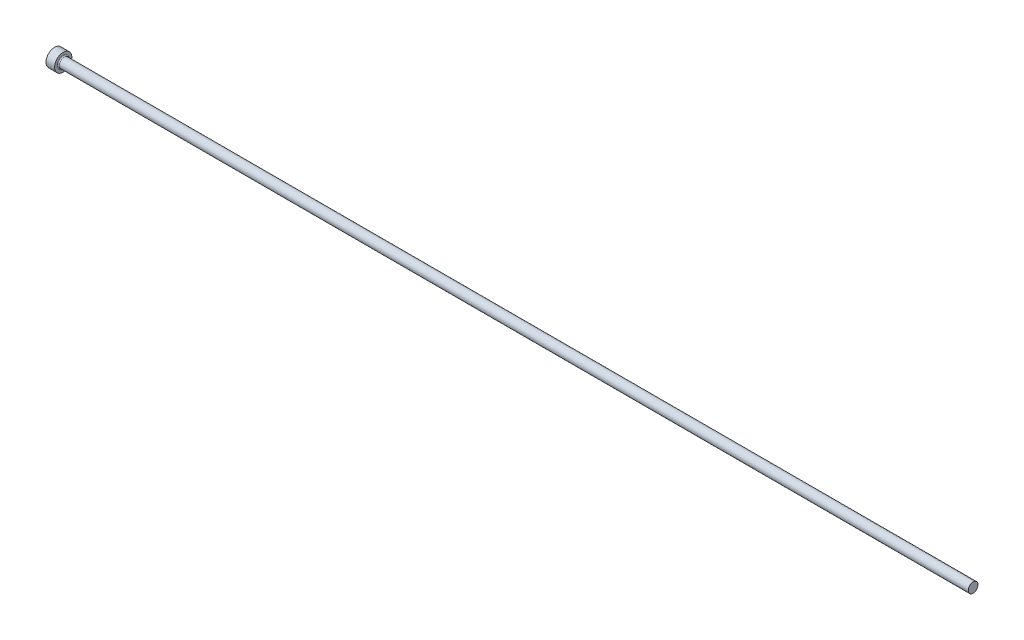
ISO-10303-21;
HEADER;
FILE_DESCRIPTION(('STEP AP214'),'2;1');
FILE_NAME('part.step','',(''),(''),'','','');
FILE_SCHEMA(('AUTOMOTIVE_DESIGN { 1 0 10303 214 1 1 1 1 }'));
ENDSEC;
DATA;
#1=APPLICATION_CONTEXT('core data for automotive mechanical design processes');
#2=APPLICATION_PROTOCOL_DEFINITION('international standard','automotive_design',2000,#1);
#3=PRODUCT_CONTEXT('',#1,'mechanical');
#4=PRODUCT('Part','Part','',(#3));
#5=PRODUCT_RELATED_PRODUCT_CATEGORY('part','',(#4));
#6=PRODUCT_DEFINITION_FORMATION('','',#4);
#7=PRODUCT_DEFINITION_CONTEXT('part definition',#1,'design');
#8=PRODUCT_DEFINITION('design','',#6,#7);
#9=PRODUCT_DEFINITION_SHAPE('','',#8);
#10=(LENGTH_UNIT() NAMED_UNIT(*) SI_UNIT(.MILLI.,.METRE.));
#11=(NAMED_UNIT(*) PLANE_ANGLE_UNIT() SI_UNIT($,.RADIAN.));
#12=(NAMED_UNIT(*) SI_UNIT($,.STERADIAN.) SOLID_ANGLE_UNIT());
#13=UNCERTAINTY_MEASURE_WITH_UNIT(LENGTH_MEASURE(1.E-05),#10,'distance_accuracy_value','');
#14=(GEOMETRIC_REPRESENTATION_CONTEXT(3) GLOBAL_UNCERTAINTY_ASSIGNED_CONTEXT((#13)) GLOBAL_UNIT_ASSIGNED_CONTEXT((#10,
#11,#12)) REPRESENTATION_CONTEXT('',''));
#15=CARTESIAN_POINT('',(0.,0.,0.));
#16=DIRECTION('',(0.,0.,1.));
#17=DIRECTION('',(1.,0.,0.));
#18=AXIS2_PLACEMENT_3D('',#15,#16,#17);
#19=CARTESIAN_POINT('',(0.,0.,0.));
#20=DIRECTION('',(-1.,0.,0.));
#21=DIRECTION('',(0.,-1.,0.));
#22=AXIS2_PLACEMENT_3D('',#19,#20,#21);
#23=PLANE('',#22);
#24=CARTESIAN_POINT('',(0.,0.,0.));
#25=DIRECTION('',(1.,0.,0.));
#26=DIRECTION('',(0.,1.,0.));
#27=AXIS2_PLACEMENT_3D('',#24,#25,#26);
#28=CIRCLE('',#27,1.5);
#29=CARTESIAN_POINT('',(0.,1.5,0.));
#30=VERTEX_POINT('',#29);
#31=EDGE_CURVE('E25',#30,#30,#28,.T.);
#32=ORIENTED_EDGE('',*,*,#31,.F.);
#33=EDGE_LOOP('',(#32));
#34=FACE_BOUND('',#33,.T.);
#35=ADVANCED_FACE('F14',(#34),#23,.T.);
#36=CARTESIAN_POINT('',(160.,0.,0.));
#37=DIRECTION('',(1.,0.,0.));
#38=DIRECTION('',(0.,1.,0.));
#39=AXIS2_PLACEMENT_3D('',#36,#37,#38);
#40=CYLINDRICAL_SURFACE('',#39,1.5);
#41=ORIENTED_EDGE('',*,*,#31,.T.);
#42=EDGE_LOOP('',(#41));
#43=FACE_BOUND('',#42,.T.);
#44=CARTESIAN_POINT('',(1.5,0.,0.));
#45=DIRECTION('',(1.,0.,0.));
#46=DIRECTION('',(0.,1.,0.));
#47=AXIS2_PLACEMENT_3D('',#44,#45,#46);
#48=CIRCLE('',#47,1.5);
#49=CARTESIAN_POINT('',(1.5,1.5,0.));
#50=VERTEX_POINT('',#49);
#51=EDGE_CURVE('E29',#50,#50,#48,.T.);
#52=ORIENTED_EDGE('',*,*,#51,.F.);
#53=EDGE_LOOP('',(#52));
#54=FACE_BOUND('',#53,.T.);
#55=ADVANCED_FACE('F51',(#43,#54),#40,.T.);
#56=CARTESIAN_POINT('',(1.5,1.5,0.));
#57=DIRECTION('',(1.,0.,0.));
#58=DIRECTION('',(0.,1.,0.));
#59=AXIS2_PLACEMENT_3D('',#56,#57,#58);
#60=PLANE('',#59);
#61=CARTESIAN_POINT('',(1.5,0.,0.));
#62=DIRECTION('',(1.,0.,0.));
#63=DIRECTION('',(0.,1.,0.));
#64=AXIS2_PLACEMENT_3D('',#61,#62,#63);
#65=CIRCLE('',#64,1.04999999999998);
#66=CARTESIAN_POINT('',(1.5,1.04999999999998,0.));
#67=VERTEX_POINT('',#66);
#68=EDGE_CURVE('E9',#67,#67,#65,.F.);
#69=ORIENTED_EDGE('',*,*,#68,.T.);
#70=EDGE_LOOP('',(#69));
#71=FACE_BOUND('',#70,.T.);
#72=ORIENTED_EDGE('',*,*,#51,.T.);
#73=EDGE_LOOP('',(#72));
#74=FACE_BOUND('',#73,.T.);
#75=ADVANCED_FACE('F42',(#71,#74),#60,.T.);
#76=CARTESIAN_POINT('',(160.,0.,0.));
#77=DIRECTION('',(1.,0.,0.));
#78=DIRECTION('',(0.,1.,0.));
#79=AXIS2_PLACEMENT_3D('',#76,#77,#78);
#80=CYLINDRICAL_SURFACE('',#79,0.849999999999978);
#81=CARTESIAN_POINT('',(1.7,0.,0.));
#82=DIRECTION('',(1.,0.,0.));
#83=DIRECTION('',(0.,1.,0.));
#84=AXIS2_PLACEMENT_3D('',#81,#82,#83);
#85=CIRCLE('',#84,0.849999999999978);
#86=CARTESIAN_POINT('',(1.7,0.849999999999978,0.));
#87=VERTEX_POINT('',#86);
#88=EDGE_CURVE('E21',#87,#87,#85,.T.);
#89=ORIENTED_EDGE('',*,*,#88,.T.);
#90=EDGE_LOOP('',(#89));
#91=FACE_BOUND('',#90,.T.);
#92=CARTESIAN_POINT('',(160.,0.,0.));
#93=DIRECTION('',(1.,0.,0.));
#94=DIRECTION('',(0.,1.,0.));
#95=AXIS2_PLACEMENT_3D('',#92,#93,#94);
#96=CIRCLE('',#95,0.849999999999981);
#97=CARTESIAN_POINT('',(160.,0.849999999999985,0.));
#98=VERTEX_POINT('',#97);
#99=EDGE_CURVE('E34',#98,#98,#96,.T.);
#100=ORIENTED_EDGE('',*,*,#99,.F.);
#101=EDGE_LOOP('',(#100));
#102=FACE_BOUND('',#101,.T.);
#103=ADVANCED_FACE('F40',(#91,#102),#80,.T.);
#104=CARTESIAN_POINT('',(160.,0.849999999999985,0.));
#105=DIRECTION('',(1.,0.,0.));
#106=DIRECTION('',(0.,1.,0.));
#107=AXIS2_PLACEMENT_3D('',#104,#105,#106);
#108=PLANE('',#107);
#109=ORIENTED_EDGE('',*,*,#99,.T.);
#110=EDGE_LOOP('',(#109));
#111=FACE_BOUND('',#110,.T.);
#112=ADVANCED_FACE('F38',(#111),#108,.T.);
#113=CARTESIAN_POINT('',(1.7,0.,0.));
#114=DIRECTION('',(1.,0.,0.));
#115=DIRECTION('',(0.,1.,0.));
#116=AXIS2_PLACEMENT_3D('',#113,#114,#115);
#117=TOROIDAL_SURFACE('',#116,1.04999999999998,0.2);
#118=ORIENTED_EDGE('',*,*,#68,.F.);
#119=EDGE_LOOP('',(#118));
#120=FACE_BOUND('',#119,.T.);
#121=ORIENTED_EDGE('',*,*,#88,.F.);
#122=EDGE_LOOP('',(#121));
#123=FACE_BOUND('',#122,.T.);
#124=ADVANCED_FACE('F16',(#120,#123),#117,.F.);
#125=CLOSED_SHELL('',(#35,#55,#75,#103,#112,#124));
#126=MANIFOLD_SOLID_BREP('B1',#125);
#127=ADVANCED_BREP_SHAPE_REPRESENTATION('',(#18,#126),#14);
#128=SHAPE_DEFINITION_REPRESENTATION(#9,#127);
ENDSEC;
END-ISO-10303-21;
